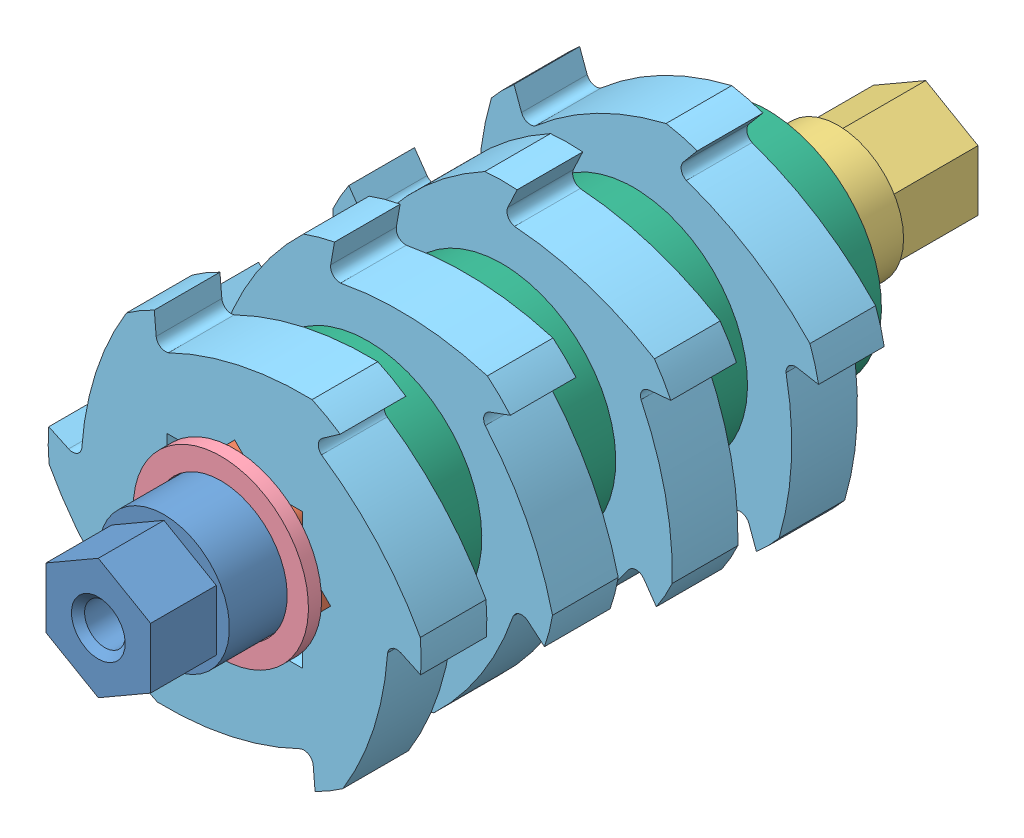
SolidWorks assembly short shaft assembly.SLDASM, configuration Default (file format 5000). Lengths in mm.
Overall size (115.39 115.09 189).
13 component instances, 6 part files, 35 mates.
Components (placement in the parent):
- for shaft1-2: for shaft1.SLDPRT [Default] at (-15 15 -56) x (1 0 0) z (0 -1 0) size (29.9 56 29.9)
- square tube_iso-2: square tube_iso.sldprt [30 x 30 x 2.0x122] at (-30 0 -92) size (30 30 122)
- for shaft1+5-3: for shaft1+5.SLDPRT [Default] at (-15 15 -128) x (-1 0 0) z (0 -1 0) size (29.9 61 29.9)
- print st-6: print st.SLDPRT [Default] at (-15 15 -28) x (-0.313696 0.949523 0) z (-0.949523 -0.313696 0) size (40 3 40)
- print st-7: print st.SLDPRT [Default] at (-15 15 -153) x (-0.580336 0.814377 0) z (-0.814377 -0.580336 0) size (40 3 40)
- bioshredder 10-7: bioshredder 10.SLDPRT [15] at (-14.85 14.85 -44.95) x (0 -1 0) z (0 0 1) size (77.56 85.2 15)
- bioshredder spacer 2-1: bioshredder spacer 2.SLDPRT [15,6] at (-15 15 -46) x (0.917794 0.397057 0) z (-0.397057 0.917794 0) size (52 15.6 52)
- bioshredder 10-8: bioshredder 10.SLDPRT [15] at (-14.85 14.85 -75.55) x (0.707107 -0.707107 0) z (0 0 1) size (77.56 85.2 15)
- bioshredder spacer 2-2: bioshredder spacer 2.SLDPRT [15,6] at (-15 15 -76.6) x (0.99848 -0.055107 0) z (0.055107 0.99848 0) size (52 15.6 52)
- bioshredder 10-9: bioshredder 10.SLDPRT [15] at (-14.85 14.85 -106.15) size (77.56 85.2 15)
- bioshredder 10-10: bioshredder 10.SLDPRT [15] at (-15.15 14.85 -136.75) x (0.707107 0.707107 0) z (0 0 1) size (77.56 85.2 15)
- bioshredder spacer 2-5: bioshredder spacer 2.SLDPRT [15,6] at (-15.5 14.5 -107.2) x (1 0 0) z (0 1 0) size (52 15.6 52)
- bioshredder spacer 2-6: bioshredder spacer 2.SLDPRT [15,6] at (-15.5 14.5 -137.8) x (1 0 0) z (0 1 0) size (52 15.6 52)
Mates (geometry in assembly coordinates):
- Coincident12: coincident aligned: plane of for shaft1-2 through (-5 5 -31) normal (0 0 1); plane of square tube_iso-2 through (-4 26 -31) normal (0 0 1)
- Coincident13: coincident anti-aligned: plane of for shaft1-2 through (-5 28 -31) normal (0 1 0); plane of square tube_iso-2 through (-4 28 -31) normal (0 -1 0)
- Coincident14: coincident anti-aligned: plane of for shaft1-2 through (-2 5 -31) normal (1 0 0); plane of square tube_iso-2 through (-2 26 -31) normal (-1 0 0)
- Coincident40: coincident anti-aligned: plane of square tube_iso-2 through (-28 4 -31) normal (1 0 0); plane of for shaft1+5-3 through (-28 5 -153) normal (-1 0 0)
- Coincident41: coincident anti-aligned: plane of square tube_iso-2 through (-4 28 -31) normal (0 -1 0); plane of for shaft1+5-3 through (-25 28 -153) normal (0 1 0)
- Coincident42: coincident anti-aligned: plane of square tube_iso-2 through (-4 26 -153) normal (0 0 -1); plane of for shaft1+5-3 through (-15 15 -153) normal (0 0 1)
- Coincident43: coincident anti-aligned: plane of square tube_iso-2 through (-4 26 -31) normal (0 0 1); plane of print st-6 through (-15 15 -31) normal (0 0 -1)
- Coincident44: coincident anti-aligned: plane of square tube_iso-2 through (-4 26 -153) normal (0 0 -1); plane of print st-7 through (-15 15 -153) normal (0 0 1)
- Concentric17: concentric anti-aligned: cylinder of for shaft1-2 through (-15 15 -15) axis (0 0 -1) radius 14.95; cylinder of print st-6 through (-15 15 -31) axis (0 0 1) radius 15.15
- Concentric18: concentric aligned: cylinder of for shaft1+5-3 through (-15 15 -169) axis (0 0 1) radius 14.95; cylinder of print st-7 through (-15 15 -156) axis (0 0 1) radius 15.15
- Distance1: distance = 0.35 mm anti-aligned: plane of square tube_iso-2 through (-4 30 -31) normal (0 1 0); plane of bioshredder 10-7 through (-30.35 30.35 -31) normal (0 -1 0)
- Distance2: distance = 0.35 mm anti-aligned: plane of square tube_iso-2 through (-30 4 -31) normal (-1 0 0); plane of bioshredder 10-7 through (-30.35 30.35 -31) normal (1 0 0)
- Coincident47: coincident anti-aligned: plane of print st-6 through (-15 15 -31) normal (0 0 -1); plane of bioshredder 10-7 through (1.0159 -16.9772 -31) normal (0 0 1)
- Concentric19: concentric anti-aligned: cylinder of for shaft1-2 through (-15 15 -15) axis (0 0 -1) radius 14.95; cylinder of bioshredder spacer 2-1 through (-15 15 -61.6) axis (0 0 1) radius 26
- Coincident48: coincident anti-aligned: plane of bioshredder 10-7 through (1.0159 -16.9772 -46) normal (0 0 -1); plane of bioshredder spacer 2-1 through (-15 15 -46) normal (0 0 1)
- Coincident49: coincident anti-aligned: plane of bioshredder spacer 2-1 through (-15 15 -61.6) normal (0 0 -1); plane of bioshredder 10-8 through (18.8741 3.5636 -61.6) normal (0 0 1)
- Coincident50: coincident aligned: plane of for shaft1-2 through (-15 15 0) normal (0 0 1); plane of assembly through (0 0 0) normal (0 0 1)
- Coincident51: coincident anti-aligned: plane of square tube_iso-2 through (-26 0 -31) normal (0 -1 0); plane of assembly through (0 0 0) normal (0 1 0)
- Coincident52: coincident aligned: plane of square tube_iso-2 through (0 26 -31) normal (1 0 0); plane of assembly through (0 0 0) normal (1 0 0)
- Distance3: distance = 0.35 mm anti-aligned: plane of square tube_iso-2 through (-30 4 -31) normal (-1 0 0); plane of bioshredder 10-8 through (-30.35 30.35 -61.6) normal (1 0 0)
- Distance4: distance = 0.35 mm anti-aligned: plane of square tube_iso-2 through (-4 30 -31) normal (0 1 0); plane of bioshredder 10-8 through (-30.35 30.35 -61.6) normal (0 -1 0)
- Concentric20: concentric aligned: cylinder of bioshredder spacer 2-1 through (-15 15 -61.6) axis (0 0 1) radius 26; cylinder of bioshredder spacer 2-2 through (-15 15 -92.2) axis (0 0 1) radius 26
- Coincident55: coincident anti-aligned: plane of bioshredder 10-8 through (18.8741 3.5636 -76.6) normal (0 0 -1); plane of bioshredder spacer 2-2 through (-15 15 -76.6) normal (0 0 1)
- Coincident56: coincident anti-aligned: plane of bioshredder spacer 2-2 through (-15 15 -92.2) normal (0 0 -1); plane of bioshredder 10-9 through (16.9772 30.7159 -92.2) normal (0 0 1)
- Distance5: distance = 0.35 mm anti-aligned: plane of square tube_iso-2 through (-4 30 -31) normal (0 1 0); plane of bioshredder 10-9 through (-30.35 30.35 -92.2) normal (0 -1 0)
- Distance6: distance = 0.35 mm anti-aligned: plane of square tube_iso-2 through (-30 4 -31) normal (-1 0 0); plane of bioshredder 10-9 through (-30.35 21.2703 -92.2) normal (1 0 0)
- Distance7: distance = 0.35 mm anti-aligned: plane of square tube_iso-2 through (-4 30 -31) normal (0 1 0); plane of bioshredder 10-10 through (-30.65 30.35 -122.8) normal (0 -1 0)
- Distance8: distance = 0.35 mm anti-aligned: plane of square tube_iso-2 through (0 26 -31) normal (1 0 0); plane of bioshredder 10-10 through (0.35 21.2703 -122.8) normal (-1 0 0)
- Coincident57: coincident aligned: plane of bioshredder spacer 2-5 through (-117.9278 -0.65 -122.8) normal (0 1 0); plane of bioshredder spacer 2-6 through (-117.9278 -0.65 -153.4) normal (0 1 0)
- Coincident58: coincident aligned: plane of bioshredder spacer 2-5 through (-146.2278 27.65 -122.8) normal (1 0 0); plane of bioshredder spacer 2-6 through (-146.2278 27.65 -153.4) normal (1 0 0)
- Coincident59: coincident aligned: plane of bioshredder 10-9 through (-8.4297 -0.65 -92.2) normal (0 1 0); plane of bioshredder spacer 2-5 through (-117.9278 -0.65 -122.8) normal (0 1 0)
- Coincident60: coincident anti-aligned: plane of bioshredder 10-10 through (-3.8636 48.5741 -122.8) normal (0 0 1); plane of bioshredder spacer 2-5 through (-131.0778 14.5 -122.8) normal (0 0 -1)
- Coincident61: coincident anti-aligned: plane of bioshredder 10-9 through (16.9772 30.7159 -107.2) normal (0 0 -1); plane of bioshredder spacer 2-5 through (-131.0778 14.5 -107.2) normal (0 0 1)
- Coincident62: coincident anti-aligned: plane of bioshredder 10-10 through (-3.8636 48.5741 -137.8) normal (0 0 -1); plane of bioshredder spacer 2-6 through (-131.0778 14.5 -137.8) normal (0 0 1)
- Coincident63: coincident aligned: plane of bioshredder 10-10 through (-30.65 21.2703 -122.8) normal (1 0 0); plane of bioshredder spacer 2-5 through (-30.65 27.65 -122.8) normal (1 0 0)
